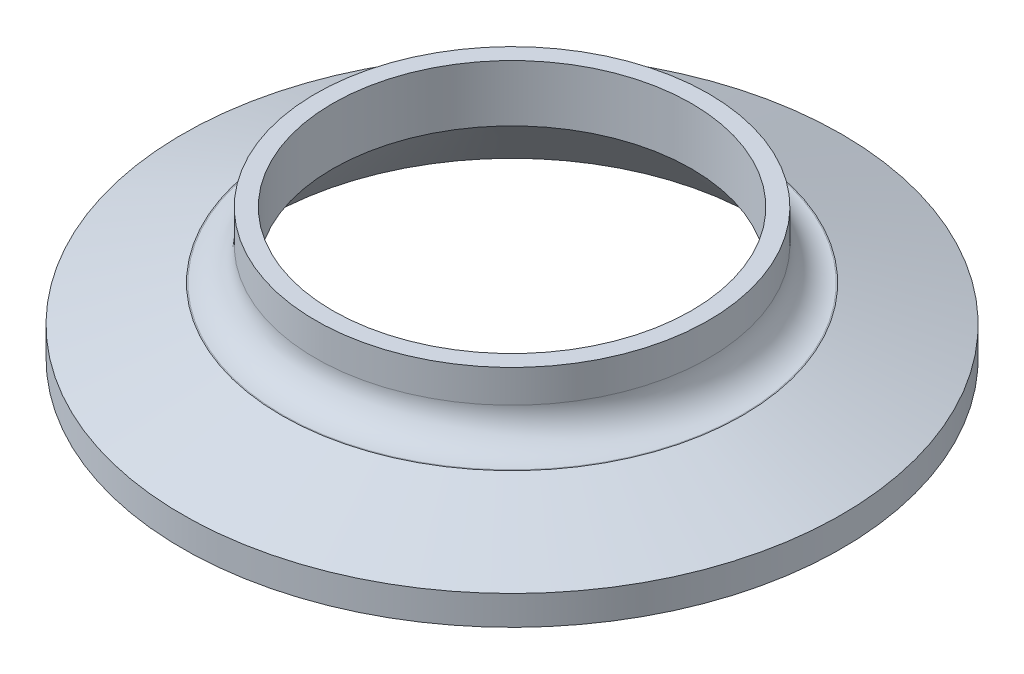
ISO-10303-21;
HEADER;
FILE_DESCRIPTION(('STEP AP214'),'2;1');
FILE_NAME('part.step','',(''),(''),'','','');
FILE_SCHEMA(('AUTOMOTIVE_DESIGN { 1 0 10303 214 1 1 1 1 }'));
ENDSEC;
DATA;
#1=APPLICATION_CONTEXT('core data for automotive mechanical design processes');
#2=APPLICATION_PROTOCOL_DEFINITION('international standard','automotive_design',2000,#1);
#3=PRODUCT_CONTEXT('',#1,'mechanical');
#4=PRODUCT('Part','Part','',(#3));
#5=PRODUCT_RELATED_PRODUCT_CATEGORY('part','',(#4));
#6=PRODUCT_DEFINITION_FORMATION('','',#4);
#7=PRODUCT_DEFINITION_CONTEXT('part definition',#1,'design');
#8=PRODUCT_DEFINITION('design','',#6,#7);
#9=PRODUCT_DEFINITION_SHAPE('','',#8);
#10=(LENGTH_UNIT() NAMED_UNIT(*) SI_UNIT(.MILLI.,.METRE.));
#11=(NAMED_UNIT(*) PLANE_ANGLE_UNIT() SI_UNIT($,.RADIAN.));
#12=(NAMED_UNIT(*) SI_UNIT($,.STERADIAN.) SOLID_ANGLE_UNIT());
#13=UNCERTAINTY_MEASURE_WITH_UNIT(LENGTH_MEASURE(1.E-05),#10,'distance_accuracy_value','');
#14=(GEOMETRIC_REPRESENTATION_CONTEXT(3) GLOBAL_UNCERTAINTY_ASSIGNED_CONTEXT((#13)) GLOBAL_UNIT_ASSIGNED_CONTEXT((#10,
#11,#12)) REPRESENTATION_CONTEXT('',''));
#15=CARTESIAN_POINT('',(0.,0.,0.));
#16=DIRECTION('',(0.,0.,1.));
#17=DIRECTION('',(1.,0.,0.));
#18=AXIS2_PLACEMENT_3D('',#15,#16,#17);
#19=CARTESIAN_POINT('',(-17.399,12.7,0.));
#20=DIRECTION('',(0.,-0.999999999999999,0.));
#21=DIRECTION('',(0.,0.,-1.));
#22=AXIS2_PLACEMENT_3D('',#19,#20,#21);
#23=PLANE('',#22);
#24=CARTESIAN_POINT('',(0.,12.7,0.));
#25=DIRECTION('',(0.,-0.999999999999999,0.));
#26=DIRECTION('',(0.,0.,-1.));
#27=AXIS2_PLACEMENT_3D('',#24,#25,#26);
#28=CIRCLE('',#27,19.05);
#29=CARTESIAN_POINT('',(0.,12.7,-19.0500000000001));
#30=VERTEX_POINT('',#29);
#31=EDGE_CURVE('E12',#30,#30,#28,.T.);
#32=ORIENTED_EDGE('',*,*,#31,.F.);
#33=EDGE_LOOP('',(#32));
#34=FACE_BOUND('',#33,.T.);
#35=CARTESIAN_POINT('',(0.,12.7,0.));
#36=DIRECTION('',(0.,-0.999999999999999,0.));
#37=DIRECTION('',(0.,0.,-1.));
#38=AXIS2_PLACEMENT_3D('',#35,#36,#37);
#39=CIRCLE('',#38,17.399);
#40=CARTESIAN_POINT('',(0.,12.7,-17.3990000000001));
#41=VERTEX_POINT('',#40);
#42=EDGE_CURVE('E87',#41,#41,#39,.T.);
#43=ORIENTED_EDGE('',*,*,#42,.T.);
#44=EDGE_LOOP('',(#43));
#45=FACE_BOUND('',#44,.T.);
#46=ADVANCED_FACE('F38',(#34,#45),#23,.F.);
#47=CARTESIAN_POINT('',(0.,0.,0.));
#48=DIRECTION('',(0.,-0.999999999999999,0.));
#49=DIRECTION('',(0.,0.,-1.));
#50=AXIS2_PLACEMENT_3D('',#47,#48,#49);
#51=CYLINDRICAL_SURFACE('',#50,19.05);
#52=CARTESIAN_POINT('',(0.,9.52499999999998,0.));
#53=DIRECTION('',(0.,-0.999999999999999,0.));
#54=DIRECTION('',(0.,0.,-1.));
#55=AXIS2_PLACEMENT_3D('',#52,#53,#54);
#56=CIRCLE('',#55,19.05);
#57=CARTESIAN_POINT('',(0.,9.52499999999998,-19.0500000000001));
#58=VERTEX_POINT('',#57);
#59=EDGE_CURVE('E44',#58,#58,#56,.T.);
#60=CARTESIAN_POINT('',(0.,9.52499999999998,-19.0500000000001));
#61=CARTESIAN_POINT('',(0.,9.55807291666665,-19.0500000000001));
#62=CARTESIAN_POINT('',(0.,9.59114583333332,-19.0500000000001));
#63=CARTESIAN_POINT('',(0.,9.65729166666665,-19.0500000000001));
#64=CARTESIAN_POINT('',(0.,9.69036458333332,-19.0500000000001));
#65=CARTESIAN_POINT('',(0.,9.75651041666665,-19.0500000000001));
#66=CARTESIAN_POINT('',(0.,9.78958333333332,-19.0500000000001));
#67=CARTESIAN_POINT('',(0.,9.85572916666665,-19.0500000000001));
#68=CARTESIAN_POINT('',(0.,9.88880208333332,-19.0500000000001));
#69=CARTESIAN_POINT('',(0.,9.95494791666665,-19.0500000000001));
#70=CARTESIAN_POINT('',(0.,9.98802083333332,-19.0500000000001));
#71=CARTESIAN_POINT('',(0.,10.0541666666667,-19.0500000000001));
#72=CARTESIAN_POINT('',(0.,10.0872395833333,-19.0500000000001));
#73=CARTESIAN_POINT('',(0.,10.1533854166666,-19.0500000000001));
#74=CARTESIAN_POINT('',(0.,10.1864583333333,-19.0500000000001));
#75=CARTESIAN_POINT('',(0.,10.2526041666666,-19.0500000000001));
#76=CARTESIAN_POINT('',(0.,10.2856770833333,-19.0500000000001));
#77=CARTESIAN_POINT('',(0.,10.3518229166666,-19.0500000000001));
#78=CARTESIAN_POINT('',(0.,10.3848958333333,-19.0500000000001));
#79=CARTESIAN_POINT('',(0.,10.4510416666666,-19.0500000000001));
#80=CARTESIAN_POINT('',(0.,10.4841145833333,-19.0500000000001));
#81=CARTESIAN_POINT('',(0.,10.5502604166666,-19.0500000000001));
#82=CARTESIAN_POINT('',(0.,10.5833333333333,-19.0500000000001));
#83=CARTESIAN_POINT('',(0.,10.6494791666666,-19.0500000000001));
#84=CARTESIAN_POINT('',(0.,10.6825520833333,-19.0500000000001));
#85=CARTESIAN_POINT('',(0.,10.7486979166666,-19.0500000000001));
#86=CARTESIAN_POINT('',(0.,10.7817708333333,-19.0500000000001));
#87=CARTESIAN_POINT('',(0.,10.8479166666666,-19.0500000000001));
#88=CARTESIAN_POINT('',(0.,10.8809895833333,-19.0500000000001));
#89=CARTESIAN_POINT('',(0.,10.9471354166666,-19.0500000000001));
#90=CARTESIAN_POINT('',(0.,10.9802083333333,-19.0500000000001));
#91=CARTESIAN_POINT('',(0.,11.0463541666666,-19.0500000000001));
#92=CARTESIAN_POINT('',(0.,11.0794270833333,-19.0500000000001));
#93=CARTESIAN_POINT('',(0.,11.1455729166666,-19.0500000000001));
#94=CARTESIAN_POINT('',(0.,11.1786458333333,-19.0500000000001));
#95=CARTESIAN_POINT('',(0.,11.2447916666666,-19.0500000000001));
#96=CARTESIAN_POINT('',(0.,11.2778645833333,-19.0500000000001));
#97=CARTESIAN_POINT('',(0.,11.3440104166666,-19.0500000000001));
#98=CARTESIAN_POINT('',(0.,11.3770833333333,-19.0500000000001));
#99=CARTESIAN_POINT('',(0.,11.4432291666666,-19.0500000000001));
#100=CARTESIAN_POINT('',(0.,11.4763020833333,-19.0500000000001));
#101=CARTESIAN_POINT('',(0.,11.5424479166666,-19.0500000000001));
#102=CARTESIAN_POINT('',(0.,11.5755208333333,-19.0500000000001));
#103=CARTESIAN_POINT('',(0.,11.6416666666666,-19.0500000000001));
#104=CARTESIAN_POINT('',(0.,11.6747395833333,-19.0500000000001));
#105=CARTESIAN_POINT('',(0.,11.7408854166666,-19.0500000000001));
#106=CARTESIAN_POINT('',(0.,11.7739583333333,-19.0500000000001));
#107=CARTESIAN_POINT('',(0.,11.8401041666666,-19.0500000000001));
#108=CARTESIAN_POINT('',(0.,11.8731770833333,-19.0500000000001));
#109=CARTESIAN_POINT('',(0.,11.9393229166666,-19.0500000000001));
#110=CARTESIAN_POINT('',(0.,11.9723958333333,-19.0500000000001));
#111=CARTESIAN_POINT('',(0.,12.0385416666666,-19.0500000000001));
#112=CARTESIAN_POINT('',(0.,12.0716145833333,-19.0500000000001));
#113=CARTESIAN_POINT('',(0.,12.1377604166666,-19.0500000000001));
#114=CARTESIAN_POINT('',(0.,12.1708333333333,-19.0500000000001));
#115=CARTESIAN_POINT('',(0.,12.2369791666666,-19.0500000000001));
#116=CARTESIAN_POINT('',(0.,12.2700520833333,-19.0500000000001));
#117=CARTESIAN_POINT('',(0.,12.3361979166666,-19.0500000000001));
#118=CARTESIAN_POINT('',(0.,12.3692708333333,-19.0500000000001));
#119=CARTESIAN_POINT('',(0.,12.4354166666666,-19.0500000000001));
#120=CARTESIAN_POINT('',(0.,12.4684895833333,-19.0500000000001));
#121=CARTESIAN_POINT('',(0.,12.5346354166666,-19.0500000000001));
#122=CARTESIAN_POINT('',(0.,12.5677083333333,-19.0500000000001));
#123=CARTESIAN_POINT('',(0.,12.6338541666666,-19.0500000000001));
#124=CARTESIAN_POINT('',(0.,12.6669270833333,-19.0500000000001));
#125=CARTESIAN_POINT('',(0.,12.7,-19.0500000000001));
#126=B_SPLINE_CURVE_WITH_KNOTS('',3,(#60,#61,#62,#63,#64,#65,#66,#67,#68,#69,#70,#71,#72,#73,
#74,#75,#76,#77,#78,#79,#80,#81,#82,#83,#84,#85,#86,#87,#88,#89,#90,#91,#92,#93,#94,#95,#96,#97,
#98,#99,#100,#101,#102,#103,#104,#105,#106,#107,#108,#109,#110,#111,#112,#113,#114,#115,#116,
#117,#118,#119,#120,#121,#122,#123,#124,#125),.UNSPECIFIED.,.F.,.F.,(4,2,2,2,2,2,2,2,2,2,2,2,2,
2,2,2,2,2,2,2,2,2,2,2,2,2,2,2,2,2,2,2,4),(0.,0.0992187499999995,0.198437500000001,0.29765625,
0.396875,0.496093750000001,0.5953125,0.694531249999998,0.793749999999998,0.892968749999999,
0.992187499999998,1.09140625,1.190625,1.28984375,1.3890625,1.48828125,1.5875,1.68671875,
1.7859375,1.88515625,1.984375,2.08359375,2.1828125,2.28203125,2.38125,2.48046875,2.5796875,
2.67890625,2.778125,2.87734375,2.9765625,3.07578125,3.175),.UNSPECIFIED.);
#127=EDGE_CURVE('BSEAM166',#58,#30,#126,.T.);
#128=ORIENTED_EDGE('',*,*,#59,.F.);
#129=ORIENTED_EDGE('',*,*,#31,.T.);
#130=ORIENTED_EDGE('',*,*,#127,.T.);
#131=ORIENTED_EDGE('',*,*,#127,.F.);
#132=EDGE_LOOP('',(#128,#130,#129,#131));
#133=FACE_BOUND('',#132,.T.);
#134=ADVANCED_FACE('F166',(#133),#51,.T.);
#135=CARTESIAN_POINT('',(0.,9.52499999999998,0.));
#136=DIRECTION('',(0.,-0.999999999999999,0.));
#137=DIRECTION('',(0.,0.,-1.));
#138=AXIS2_PLACEMENT_3D('',#135,#136,#137);
#139=TOROIDAL_SURFACE('',#138,22.225,3.175);
#140=CARTESIAN_POINT('',(0.,6.34999999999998,0.));
#141=DIRECTION('',(0.,-0.999999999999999,0.));
#142=DIRECTION('',(0.,0.,-1.));
#143=AXIS2_PLACEMENT_3D('',#140,#141,#142);
#144=CIRCLE('',#143,22.225);
#145=CARTESIAN_POINT('',(0.,6.34999999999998,-22.2250000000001));
#146=VERTEX_POINT('',#145);
#147=EDGE_CURVE('E48',#146,#146,#144,.T.);
#148=ORIENTED_EDGE('',*,*,#147,.F.);
#149=EDGE_LOOP('',(#148));
#150=FACE_BOUND('',#149,.T.);
#151=ORIENTED_EDGE('',*,*,#59,.T.);
#152=EDGE_LOOP('',(#151));
#153=FACE_BOUND('',#152,.T.);
#154=ADVANCED_FACE('F161',(#150,#153),#139,.F.);
#155=CARTESIAN_POINT('',(-22.225,6.35,0.));
#156=DIRECTION('',(0.,-0.999999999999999,0.));
#157=DIRECTION('',(0.,0.,-1.));
#158=AXIS2_PLACEMENT_3D('',#155,#156,#157);
#159=PLANE('',#158);
#160=CARTESIAN_POINT('',(0.,6.34999999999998,0.));
#161=DIRECTION('',(0.,-0.999999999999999,0.));
#162=DIRECTION('',(0.,0.,-1.));
#163=AXIS2_PLACEMENT_3D('',#160,#161,#162);
#164=CIRCLE('',#163,22.3227421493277);
#165=CARTESIAN_POINT('',(0.,6.34999999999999,-22.3227421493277));
#166=VERTEX_POINT('',#165);
#167=EDGE_CURVE('E52',#166,#166,#164,.T.);
#168=ORIENTED_EDGE('',*,*,#167,.F.);
#169=EDGE_LOOP('',(#168));
#170=FACE_BOUND('',#169,.T.);
#171=ORIENTED_EDGE('',*,*,#147,.T.);
#172=EDGE_LOOP('',(#171));
#173=FACE_BOUND('',#172,.T.);
#174=ADVANCED_FACE('F155',(#170,#173),#159,.F.);
#175=CARTESIAN_POINT('',(0.,6.34999999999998,0.));
#176=DIRECTION('',(0.,-0.999999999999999,0.));
#177=DIRECTION('',(0.,0.,-1.));
#178=AXIS2_PLACEMENT_3D('',#175,#176,#177);
#179=CONICAL_SURFACE('',#178,22.3227421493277,1.22173047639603);
#180=CARTESIAN_POINT('',(0.,2.84479999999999,0.));
#181=DIRECTION('',(0.,-0.999999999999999,0.));
#182=DIRECTION('',(0.,0.,-1.));
#183=AXIS2_PLACEMENT_3D('',#180,#181,#182);
#184=CIRCLE('',#183,31.9532);
#185=CARTESIAN_POINT('',(0.,2.8448,-31.9532000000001));
#186=VERTEX_POINT('',#185);
#187=EDGE_CURVE('E57',#186,#186,#184,.T.);
#188=CARTESIAN_POINT('',(0.,2.8448,-31.9532000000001));
#189=CARTESIAN_POINT('',(0.,2.8813125,-31.8528827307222));
#190=CARTESIAN_POINT('',(0.,2.917825,-31.7525654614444));
#191=CARTESIAN_POINT('',(0.,2.99085,-31.5519309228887));
#192=CARTESIAN_POINT('',(0.,3.0273625,-31.4516136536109));
#193=CARTESIAN_POINT('',(0.,3.1003875,-31.2509791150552));
#194=CARTESIAN_POINT('',(0.,3.1369,-31.1506618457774));
#195=CARTESIAN_POINT('',(0.,3.209925,-30.9500273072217));
#196=CARTESIAN_POINT('',(0.,3.2464375,-30.8497100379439));
#197=CARTESIAN_POINT('',(0.,3.3194625,-30.6490754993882));
#198=CARTESIAN_POINT('',(0.,3.355975,-30.5487582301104));
#199=CARTESIAN_POINT('',(0.,3.429,-30.3481236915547));
#200=CARTESIAN_POINT('',(0.,3.4655125,-30.2478064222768));
#201=CARTESIAN_POINT('',(0.,3.5385375,-30.0471718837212));
#202=CARTESIAN_POINT('',(0.,3.57505,-29.9468546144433));
#203=CARTESIAN_POINT('',(0.,3.648075,-29.7462200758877));
#204=CARTESIAN_POINT('',(0.,3.6845875,-29.6459028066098));
#205=CARTESIAN_POINT('',(0.,3.7576125,-29.4452682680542));
#206=CARTESIAN_POINT('',(0.,3.794125,-29.3449509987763));
#207=CARTESIAN_POINT('',(0.,3.86715,-29.1443164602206));
#208=CARTESIAN_POINT('',(0.,3.9036625,-29.0439991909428));
#209=CARTESIAN_POINT('',(0.,3.9766875,-28.8433646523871));
#210=CARTESIAN_POINT('',(0.,4.01319999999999,-28.7430473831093));
#211=CARTESIAN_POINT('',(0.,4.08622499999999,-28.5424128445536));
#212=CARTESIAN_POINT('',(0.,4.1227375,-28.4420955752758));
#213=CARTESIAN_POINT('',(0.,4.19576249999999,-28.2414610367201));
#214=CARTESIAN_POINT('',(0.,4.23227499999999,-28.1411437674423));
#215=CARTESIAN_POINT('',(0.,4.30529999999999,-27.9405092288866));
#216=CARTESIAN_POINT('',(0.,4.34181249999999,-27.8401919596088));
#217=CARTESIAN_POINT('',(0.,4.41483749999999,-27.6395574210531));
#218=CARTESIAN_POINT('',(0.,4.45134999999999,-27.5392401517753));
#219=CARTESIAN_POINT('',(0.,4.52437499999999,-27.3386056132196));
#220=CARTESIAN_POINT('',(0.,4.56088749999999,-27.2382883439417));
#221=CARTESIAN_POINT('',(0.,4.63391249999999,-27.0376538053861));
#222=CARTESIAN_POINT('',(0.,4.67042499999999,-26.9373365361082));
#223=CARTESIAN_POINT('',(0.,4.74344999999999,-26.7367019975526));
#224=CARTESIAN_POINT('',(0.,4.77996249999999,-26.6363847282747));
#225=CARTESIAN_POINT('',(0.,4.85298749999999,-26.4357501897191));
#226=CARTESIAN_POINT('',(0.,4.88949999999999,-26.3354329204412));
#227=CARTESIAN_POINT('',(0.,4.96252499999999,-26.1347983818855));
#228=CARTESIAN_POINT('',(0.,4.99903749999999,-26.0344811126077));
#229=CARTESIAN_POINT('',(0.,5.07206249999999,-25.833846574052));
#230=CARTESIAN_POINT('',(0.,5.10857499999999,-25.7335293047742));
#231=CARTESIAN_POINT('',(0.,5.18159999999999,-25.5328947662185));
#232=CARTESIAN_POINT('',(0.,5.21811249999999,-25.4325774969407));
#233=CARTESIAN_POINT('',(0.,5.29113749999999,-25.231942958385));
#234=CARTESIAN_POINT('',(0.,5.32764999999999,-25.1316256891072));
#235=CARTESIAN_POINT('',(0.,5.40067499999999,-24.9309911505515));
#236=CARTESIAN_POINT('',(0.,5.43718749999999,-24.8306738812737));
#237=CARTESIAN_POINT('',(0.,5.51021249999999,-24.630039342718));
#238=CARTESIAN_POINT('',(0.,5.54672499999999,-24.5297220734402));
#239=CARTESIAN_POINT('',(0.,5.61974999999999,-24.3290875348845));
#240=CARTESIAN_POINT('',(0.,5.65626249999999,-24.2287702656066));
#241=CARTESIAN_POINT('',(0.,5.72928749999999,-24.028135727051));
#242=CARTESIAN_POINT('',(0.,5.76579999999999,-23.9278184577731));
#243=CARTESIAN_POINT('',(0.,5.83882499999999,-23.7271839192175));
#244=CARTESIAN_POINT('',(0.,5.87533749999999,-23.6268666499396));
#245=CARTESIAN_POINT('',(0.,5.94836249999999,-23.4262321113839));
#246=CARTESIAN_POINT('',(0.,5.98487499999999,-23.3259148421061));
#247=CARTESIAN_POINT('',(0.,6.05789999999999,-23.1252803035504));
#248=CARTESIAN_POINT('',(0.,6.09441249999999,-23.0249630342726));
#249=CARTESIAN_POINT('',(0.,6.16743749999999,-22.8243284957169));
#250=CARTESIAN_POINT('',(0.,6.20394999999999,-22.7240112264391));
#251=CARTESIAN_POINT('',(0.,6.27697499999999,-22.5233766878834));
#252=CARTESIAN_POINT('',(0.,6.31348749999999,-22.4230594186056));
#253=CARTESIAN_POINT('',(0.,6.34999999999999,-22.3227421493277));
#254=B_SPLINE_CURVE_WITH_KNOTS('',3,(#188,#189,#190,#191,#192,#193,#194,#195,#196,#197,#198,
#199,#200,#201,#202,#203,#204,#205,#206,#207,#208,#209,#210,#211,#212,#213,#214,#215,#216,#217,
#218,#219,#220,#221,#222,#223,#224,#225,#226,#227,#228,#229,#230,#231,#232,#233,#234,#235,#236,
#237,#238,#239,#240,#241,#242,#243,#244,#245,#246,#247,#248,#249,#250,#251,#252,#253),
.UNSPECIFIED.,.F.,.F.,(4,2,2,2,2,2,2,2,2,2,2,2,2,2,2,2,2,2,2,2,2,2,2,2,2,2,2,2,2,2,2,2,4),(0.,
0.320266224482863,0.640532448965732,0.960798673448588,1.28106489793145,1.60133112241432,
1.92159734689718,2.24186357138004,2.56212979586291,2.88239602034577,3.20266224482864,
3.5229284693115,3.84319469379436,4.16346091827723,4.48372714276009,4.80399336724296,
5.12425959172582,5.44452581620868,5.76479204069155,6.08505826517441,6.40532448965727,
6.72559071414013,7.045856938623,7.36612316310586,7.68638938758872,8.00665561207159,
8.32692183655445,8.64718806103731,8.96745428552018,9.28772051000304,9.60798673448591,
9.92825295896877,10.2485191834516),.UNSPECIFIED.);
#255=EDGE_CURVE('BSEAM149',#186,#166,#254,.T.);
#256=ORIENTED_EDGE('',*,*,#187,.F.);
#257=ORIENTED_EDGE('',*,*,#167,.T.);
#258=ORIENTED_EDGE('',*,*,#255,.T.);
#259=ORIENTED_EDGE('',*,*,#255,.F.);
#260=EDGE_LOOP('',(#256,#258,#257,#259));
#261=FACE_BOUND('',#260,.T.);
#262=ADVANCED_FACE('F149',(#261),#179,.T.);
#263=CARTESIAN_POINT('',(0.,0.,0.));
#264=DIRECTION('',(0.,-0.999999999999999,0.));
#265=DIRECTION('',(0.,0.,-1.));
#266=AXIS2_PLACEMENT_3D('',#263,#264,#265);
#267=CYLINDRICAL_SURFACE('',#266,31.9532);
#268=CARTESIAN_POINT('',(0.,0.,0.));
#269=DIRECTION('',(0.,-0.999999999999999,0.));
#270=DIRECTION('',(0.,0.,-1.));
#271=AXIS2_PLACEMENT_3D('',#268,#269,#270);
#272=CIRCLE('',#271,31.9532);
#273=CARTESIAN_POINT('',(0.,0.,-31.9532000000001));
#274=VERTEX_POINT('',#273);
#275=EDGE_CURVE('E60',#274,#274,#272,.T.);
#276=CARTESIAN_POINT('',(0.,0.,-31.9532000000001));
#277=CARTESIAN_POINT('',(0.,0.0296333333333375,-31.9532000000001));
#278=CARTESIAN_POINT('',(0.,0.0592666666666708,-31.9532000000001));
#279=CARTESIAN_POINT('',(0.,0.118533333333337,-31.9532000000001));
#280=CARTESIAN_POINT('',(0.,0.148166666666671,-31.9532000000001));
#281=CARTESIAN_POINT('',(0.,0.207433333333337,-31.9532000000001));
#282=CARTESIAN_POINT('',(0.,0.23706666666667,-31.9532000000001));
#283=CARTESIAN_POINT('',(0.,0.296333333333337,-31.9532000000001));
#284=CARTESIAN_POINT('',(0.,0.32596666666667,-31.9532000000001));
#285=CARTESIAN_POINT('',(0.,0.385233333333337,-31.9532000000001));
#286=CARTESIAN_POINT('',(0.,0.41486666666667,-31.9532000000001));
#287=CARTESIAN_POINT('',(0.,0.474133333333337,-31.9532000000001));
#288=CARTESIAN_POINT('',(0.,0.50376666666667,-31.9532000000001));
#289=CARTESIAN_POINT('',(0.,0.563033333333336,-31.9532000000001));
#290=CARTESIAN_POINT('',(0.,0.59266666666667,-31.9532000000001));
#291=CARTESIAN_POINT('',(0.,0.651933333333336,-31.9532000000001));
#292=CARTESIAN_POINT('',(0.,0.681566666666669,-31.9532000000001));
#293=CARTESIAN_POINT('',(0.,0.740833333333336,-31.9532000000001));
#294=CARTESIAN_POINT('',(0.,0.770466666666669,-31.9532000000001));
#295=CARTESIAN_POINT('',(0.,0.829733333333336,-31.9532000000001));
#296=CARTESIAN_POINT('',(0.,0.859366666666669,-31.9532000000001));
#297=CARTESIAN_POINT('',(0.,0.918633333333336,-31.9532000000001));
#298=CARTESIAN_POINT('',(0.,0.948266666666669,-31.9532000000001));
#299=CARTESIAN_POINT('',(0.,1.00753333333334,-31.9532000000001));
#300=CARTESIAN_POINT('',(0.,1.03716666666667,-31.9532000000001));
#301=CARTESIAN_POINT('',(0.,1.09643333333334,-31.9532000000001));
#302=CARTESIAN_POINT('',(0.,1.12606666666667,-31.9532000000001));
#303=CARTESIAN_POINT('',(0.,1.18533333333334,-31.9532000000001));
#304=CARTESIAN_POINT('',(0.,1.21496666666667,-31.9532000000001));
#305=CARTESIAN_POINT('',(0.,1.27423333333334,-31.9532000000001));
#306=CARTESIAN_POINT('',(0.,1.30386666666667,-31.9532000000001));
#307=CARTESIAN_POINT('',(0.,1.36313333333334,-31.9532000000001));
#308=CARTESIAN_POINT('',(0.,1.39276666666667,-31.9532000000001));
#309=CARTESIAN_POINT('',(0.,1.45203333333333,-31.9532000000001));
#310=CARTESIAN_POINT('',(0.,1.48166666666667,-31.9532000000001));
#311=CARTESIAN_POINT('',(0.,1.54093333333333,-31.9532000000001));
#312=CARTESIAN_POINT('',(0.,1.57056666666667,-31.9532000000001));
#313=CARTESIAN_POINT('',(0.,1.62983333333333,-31.9532000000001));
#314=CARTESIAN_POINT('',(0.,1.65946666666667,-31.9532000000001));
#315=CARTESIAN_POINT('',(0.,1.71873333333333,-31.9532000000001));
#316=CARTESIAN_POINT('',(0.,1.74836666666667,-31.9532000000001));
#317=CARTESIAN_POINT('',(0.,1.80763333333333,-31.9532000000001));
#318=CARTESIAN_POINT('',(0.,1.83726666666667,-31.9532000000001));
#319=CARTESIAN_POINT('',(0.,1.89653333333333,-31.9532000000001));
#320=CARTESIAN_POINT('',(0.,1.92616666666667,-31.9532000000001));
#321=CARTESIAN_POINT('',(0.,1.98543333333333,-31.9532000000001));
#322=CARTESIAN_POINT('',(0.,2.01506666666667,-31.9532000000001));
#323=CARTESIAN_POINT('',(0.,2.07433333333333,-31.9532000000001));
#324=CARTESIAN_POINT('',(0.,2.10396666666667,-31.9532000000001));
#325=CARTESIAN_POINT('',(0.,2.16323333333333,-31.9532000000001));
#326=CARTESIAN_POINT('',(0.,2.19286666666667,-31.9532000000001));
#327=CARTESIAN_POINT('',(0.,2.25213333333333,-31.9532000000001));
#328=CARTESIAN_POINT('',(0.,2.28176666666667,-31.9532000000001));
#329=CARTESIAN_POINT('',(0.,2.34103333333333,-31.9532000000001));
#330=CARTESIAN_POINT('',(0.,2.37066666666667,-31.9532000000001));
#331=CARTESIAN_POINT('',(0.,2.42993333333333,-31.9532000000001));
#332=CARTESIAN_POINT('',(0.,2.45956666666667,-31.9532000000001));
#333=CARTESIAN_POINT('',(0.,2.51883333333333,-31.9532000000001));
#334=CARTESIAN_POINT('',(0.,2.54846666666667,-31.9532000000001));
#335=CARTESIAN_POINT('',(0.,2.60773333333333,-31.9532000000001));
#336=CARTESIAN_POINT('',(0.,2.63736666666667,-31.9532000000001));
#337=CARTESIAN_POINT('',(0.,2.69663333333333,-31.9532000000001));
#338=CARTESIAN_POINT('',(0.,2.72626666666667,-31.9532000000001));
#339=CARTESIAN_POINT('',(0.,2.78553333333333,-31.9532000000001));
#340=CARTESIAN_POINT('',(0.,2.81516666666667,-31.9532000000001));
#341=CARTESIAN_POINT('',(0.,2.8448,-31.9532000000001));
#342=B_SPLINE_CURVE_WITH_KNOTS('',3,(#276,#277,#278,#279,#280,#281,#282,#283,#284,#285,#286,
#287,#288,#289,#290,#291,#292,#293,#294,#295,#296,#297,#298,#299,#300,#301,#302,#303,#304,#305,
#306,#307,#308,#309,#310,#311,#312,#313,#314,#315,#316,#317,#318,#319,#320,#321,#322,#323,#324,
#325,#326,#327,#328,#329,#330,#331,#332,#333,#334,#335,#336,#337,#338,#339,#340,#341),
.UNSPECIFIED.,.F.,.F.,(4,2,2,2,2,2,2,2,2,2,2,2,2,2,2,2,2,2,2,2,2,2,2,2,2,2,2,2,2,2,2,2,4),(0.,
0.0888999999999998,0.1778,0.2667,0.355599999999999,0.444499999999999,0.533399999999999,
0.622299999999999,0.711199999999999,0.800099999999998,0.888999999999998,0.977899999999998,
1.0668,1.1557,1.2446,1.3335,1.4224,1.5113,1.6002,1.6891,1.778,1.8669,1.9558,2.0447,2.1336,
2.2225,2.3114,2.4003,2.4892,2.57809999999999,2.66699999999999,2.75589999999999,
2.84479999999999),.UNSPECIFIED.);
#343=EDGE_CURVE('BSEAM143',#274,#186,#342,.T.);
#344=ORIENTED_EDGE('',*,*,#275,.F.);
#345=ORIENTED_EDGE('',*,*,#187,.T.);
#346=ORIENTED_EDGE('',*,*,#343,.T.);
#347=ORIENTED_EDGE('',*,*,#343,.F.);
#348=EDGE_LOOP('',(#344,#346,#345,#347));
#349=FACE_BOUND('',#348,.T.);
#350=ADVANCED_FACE('F143',(#349),#267,.T.);
#351=CARTESIAN_POINT('',(0.,0.,0.));
#352=DIRECTION('',(0.,-0.999999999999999,0.));
#353=DIRECTION('',(0.,0.,-1.));
#354=AXIS2_PLACEMENT_3D('',#351,#352,#353);
#355=CONICAL_SURFACE('',#354,31.9532,1.56939586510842);
#356=CARTESIAN_POINT('',(0.,0.0025124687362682,0.));
#357=DIRECTION('',(0.,-0.999999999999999,0.));
#358=DIRECTION('',(0.,0.,-1.));
#359=AXIS2_PLACEMENT_3D('',#356,#357,#358);
#360=CIRCLE('',#359,30.1591722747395);
#361=CARTESIAN_POINT('',(0.,0.00251246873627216,-30.1591722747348));
#362=VERTEX_POINT('',#361);
#363=EDGE_CURVE('E63',#362,#362,#360,.T.);
#364=CARTESIAN_POINT('',(0.,0.00251246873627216,-30.1591722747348));
#365=CARTESIAN_POINT('',(0.,0.00248629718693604,-30.1778600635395));
#366=CARTESIAN_POINT('',(0.,0.00246012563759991,-30.1965478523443));
#367=CARTESIAN_POINT('',(0.,0.00240778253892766,-30.2339234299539));
#368=CARTESIAN_POINT('',(0.,0.00238161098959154,-30.2526112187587));
#369=CARTESIAN_POINT('',(0.,0.00232926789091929,-30.2899867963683));
#370=CARTESIAN_POINT('',(0.,0.00230309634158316,-30.308674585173));
#371=CARTESIAN_POINT('',(0.,0.00225075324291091,-30.3460501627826));
#372=CARTESIAN_POINT('',(0.,0.00222458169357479,-30.3647379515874));
#373=CARTESIAN_POINT('',(0.,0.00217223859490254,-30.402113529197));
#374=CARTESIAN_POINT('',(0.,0.00214606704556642,-30.4208013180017));
#375=CARTESIAN_POINT('',(0.,0.00209372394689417,-30.4581768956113));
#376=CARTESIAN_POINT('',(0.,0.00206755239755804,-30.4768646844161));
#377=CARTESIAN_POINT('',(0.,0.00201520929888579,-30.5142402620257));
#378=CARTESIAN_POINT('',(0.,0.00198903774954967,-30.5329280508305));
#379=CARTESIAN_POINT('',(0.,0.00193669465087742,-30.57030362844));
#380=CARTESIAN_POINT('',(0.,0.00191052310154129,-30.5889914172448));
#381=CARTESIAN_POINT('',(0.,0.00185818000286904,-30.6263669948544));
#382=CARTESIAN_POINT('',(0.,0.00183200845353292,-30.6450547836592));
#383=CARTESIAN_POINT('',(0.,0.00177966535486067,-30.6824303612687));
#384=CARTESIAN_POINT('',(0.,0.00175349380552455,-30.7011181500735));
#385=CARTESIAN_POINT('',(0.,0.0017011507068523,-30.7384937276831));
#386=CARTESIAN_POINT('',(0.,0.00167497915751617,-30.7571815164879));
#387=CARTESIAN_POINT('',(0.,0.00162263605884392,-30.7945570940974));
#388=CARTESIAN_POINT('',(0.,0.0015964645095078,-30.8132448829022));
#389=CARTESIAN_POINT('',(0.,0.00154412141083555,-30.8506204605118));
#390=CARTESIAN_POINT('',(0.,0.00151794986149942,-30.8693082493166));
#391=CARTESIAN_POINT('',(0.,0.00146560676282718,-30.9066838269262));
#392=CARTESIAN_POINT('',(0.,0.00143943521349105,-30.9253716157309));
#393=CARTESIAN_POINT('',(0.,0.0013870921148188,-30.9627471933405));
#394=CARTESIAN_POINT('',(0.,0.00136092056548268,-30.9814349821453));
#395=CARTESIAN_POINT('',(0.,0.00130857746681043,-31.0188105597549));
#396=CARTESIAN_POINT('',(0.,0.0012824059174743,-31.0374983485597));
#397=CARTESIAN_POINT('',(0.,0.00123006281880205,-31.0748739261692));
#398=CARTESIAN_POINT('',(0.,0.00120389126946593,-31.093561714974));
#399=CARTESIAN_POINT('',(0.,0.00115154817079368,-31.1309372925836));
#400=CARTESIAN_POINT('',(0.,0.00112537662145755,-31.1496250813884));
#401=CARTESIAN_POINT('',(0.,0.0010730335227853,-31.1870006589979));
#402=CARTESIAN_POINT('',(0.,0.00104686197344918,-31.2056884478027));
#403=CARTESIAN_POINT('',(0.,0.000994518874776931,-31.2430640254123));
#404=CARTESIAN_POINT('',(0.,0.000968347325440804,-31.2617518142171));
#405=CARTESIAN_POINT('',(0.,0.000916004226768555,-31.2991273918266));
#406=CARTESIAN_POINT('',(0.,0.000889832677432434,-31.3178151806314));
#407=CARTESIAN_POINT('',(0.,0.000837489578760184,-31.355190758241));
#408=CARTESIAN_POINT('',(0.,0.000811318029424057,-31.3738785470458));
#409=CARTESIAN_POINT('',(0.,0.000758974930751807,-31.4112541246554));
#410=CARTESIAN_POINT('',(0.,0.000732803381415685,-31.4299419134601));
#411=CARTESIAN_POINT('',(0.,0.000680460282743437,-31.4673174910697));
#412=CARTESIAN_POINT('',(0.,0.000654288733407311,-31.4860052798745));
#413=CARTESIAN_POINT('',(0.,0.00060194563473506,-31.5233808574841));
#414=CARTESIAN_POINT('',(0.,0.000575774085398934,-31.5420686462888));
#415=CARTESIAN_POINT('',(0.,0.000523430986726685,-31.5794442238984));
#416=CARTESIAN_POINT('',(0.,0.000497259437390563,-31.5981320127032));
#417=CARTESIAN_POINT('',(0.,0.000444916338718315,-31.6355075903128));
#418=CARTESIAN_POINT('',(0.,0.000418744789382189,-31.6541953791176));
#419=CARTESIAN_POINT('',(0.,0.000366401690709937,-31.6915709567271));
#420=CARTESIAN_POINT('',(0.,0.000340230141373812,-31.7102587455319));
#421=CARTESIAN_POINT('',(0.,0.000287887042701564,-31.7476343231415));
#422=CARTESIAN_POINT('',(0.,0.000261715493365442,-31.7663221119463));
#423=CARTESIAN_POINT('',(0.,0.000209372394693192,-31.8036976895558));
#424=CARTESIAN_POINT('',(0.,0.000183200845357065,-31.8223854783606));
#425=CARTESIAN_POINT('',(0.,0.000130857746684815,-31.8597610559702));
#426=CARTESIAN_POINT('',(0.,0.000104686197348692,-31.878448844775));
#427=CARTESIAN_POINT('',(0.,5.23430986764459E-05,-31.9158244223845));
#428=CARTESIAN_POINT('',(0.,2.61715493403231E-05,-31.9345122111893));
#429=CARTESIAN_POINT('',(0.,0.,-31.9531999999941));
#430=B_SPLINE_CURVE_WITH_KNOTS('',3,(#364,#365,#366,#367,#368,#369,#370,#371,#372,#373,#374,
#375,#376,#377,#378,#379,#380,#381,#382,#383,#384,#385,#386,#387,#388,#389,#390,#391,#392,#393,
#394,#395,#396,#397,#398,#399,#400,#401,#402,#403,#404,#405,#406,#407,#408,#409,#410,#411,#412,
#413,#414,#415,#416,#417,#418,#419,#420,#421,#422,#423,#424,#425,#426,#427,#428,#429),
.UNSPECIFIED.,.F.,.F.,(4,2,2,2,2,2,2,2,2,2,2,2,2,2,2,2,2,2,2,2,2,2,2,2,2,2,2,2,2,2,2,2,4),(0.,
0.0560634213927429,0.112126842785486,0.168190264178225,0.224253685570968,0.280317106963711,
0.336380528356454,0.392443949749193,0.448507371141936,0.504570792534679,0.560634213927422,
0.616697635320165,0.672761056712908,0.728824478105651,0.784887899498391,0.840951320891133,
0.897014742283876,0.953078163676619,1.00914158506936,1.0652050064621,1.12126842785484,
1.17733184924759,1.23339527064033,1.28945869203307,1.34552211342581,1.40158553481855,
1.4576489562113,1.51371237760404,1.56977579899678,1.62583922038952,1.68190264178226,
1.73796606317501,1.79402948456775),.UNSPECIFIED.);
#431=EDGE_CURVE('BSEAM137',#362,#274,#430,.T.);
#432=ORIENTED_EDGE('',*,*,#363,.F.);
#433=ORIENTED_EDGE('',*,*,#275,.T.);
#434=ORIENTED_EDGE('',*,*,#431,.T.);
#435=ORIENTED_EDGE('',*,*,#431,.F.);
#436=EDGE_LOOP('',(#432,#434,#433,#435));
#437=FACE_BOUND('',#436,.T.);
#438=ADVANCED_FACE('F137',(#437),#355,.F.);
#439=CARTESIAN_POINT('',(0.,0.789912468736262,0.));
#440=DIRECTION('',(0.,-0.999999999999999,0.));
#441=DIRECTION('',(0.,0.,-1.));
#442=AXIS2_PLACEMENT_3D('',#439,#440,#441);
#443=TOROIDAL_SURFACE('',#442,30.1591722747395,0.787400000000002);
#444=CARTESIAN_POINT('',(0.,0.482250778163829,0.));
#445=DIRECTION('',(0.,-0.999999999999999,0.));
#446=DIRECTION('',(0.,0.,-1.));
#447=AXIS2_PLACEMENT_3D('',#444,#445,#446);
#448=CIRCLE('',#447,29.434366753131);
#449=CARTESIAN_POINT('',(0.,0.482250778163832,-29.4343667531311));
#450=VERTEX_POINT('',#449);
#451=EDGE_CURVE('E66',#450,#450,#448,.T.);
#452=ORIENTED_EDGE('',*,*,#451,.F.);
#453=EDGE_LOOP('',(#452));
#454=FACE_BOUND('',#453,.T.);
#455=ORIENTED_EDGE('',*,*,#363,.T.);
#456=EDGE_LOOP('',(#455));
#457=FACE_BOUND('',#456,.T.);
#458=ADVANCED_FACE('F131',(#454,#457),#443,.T.);
#459=CARTESIAN_POINT('',(0.,0.482250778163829,0.));
#460=DIRECTION('',(0.,-0.999999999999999,0.));
#461=DIRECTION('',(0.,0.,-1.));
#462=AXIS2_PLACEMENT_3D('',#459,#460,#461);
#463=CONICAL_SURFACE('',#462,29.434366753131,0.401425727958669);
#464=CARTESIAN_POINT('',(0.,0.875367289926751,0.));
#465=DIRECTION('',(0.,-0.999999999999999,0.));
#466=DIRECTION('',(0.,0.,-1.));
#467=AXIS2_PLACEMENT_3D('',#464,#465,#466);
#468=CIRCLE('',#467,29.2674986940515);
#469=CARTESIAN_POINT('',(0.,0.875367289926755,-29.2674986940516));
#470=VERTEX_POINT('',#469);
#471=EDGE_CURVE('E69',#470,#470,#468,.T.);
#472=CARTESIAN_POINT('',(0.,0.875367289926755,-29.2674986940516));
#473=CARTESIAN_POINT('',(0.,0.871272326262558,-29.2692369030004));
#474=CARTESIAN_POINT('',(0.,0.867177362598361,-29.2709751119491));
#475=CARTESIAN_POINT('',(0.,0.858987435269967,-29.2744515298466));
#476=CARTESIAN_POINT('',(0.,0.854892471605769,-29.2761897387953));
#477=CARTESIAN_POINT('',(0.,0.846702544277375,-29.2796661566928));
#478=CARTESIAN_POINT('',(0.,0.842607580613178,-29.2814043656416));
#479=CARTESIAN_POINT('',(0.,0.834417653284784,-29.2848807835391));
#480=CARTESIAN_POINT('',(0.,0.830322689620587,-29.2866189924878));
#481=CARTESIAN_POINT('',(0.,0.822132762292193,-29.2900954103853));
#482=CARTESIAN_POINT('',(0.,0.818037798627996,-29.2918336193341));
#483=CARTESIAN_POINT('',(0.,0.809847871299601,-29.2953100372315));
#484=CARTESIAN_POINT('',(0.,0.805752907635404,-29.2970482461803));
#485=CARTESIAN_POINT('',(0.,0.79756298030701,-29.3005246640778));
#486=CARTESIAN_POINT('',(0.,0.793468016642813,-29.3022628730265));
#487=CARTESIAN_POINT('',(0.,0.785278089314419,-29.305739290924));
#488=CARTESIAN_POINT('',(0.,0.781183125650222,-29.3074774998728));
#489=CARTESIAN_POINT('',(0.,0.772993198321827,-29.3109539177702));
#490=CARTESIAN_POINT('',(0.,0.76889823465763,-29.312692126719));
#491=CARTESIAN_POINT('',(0.,0.760708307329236,-29.3161685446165));
#492=CARTESIAN_POINT('',(0.,0.756613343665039,-29.3179067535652));
#493=CARTESIAN_POINT('',(0.,0.748423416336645,-29.3213831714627));
#494=CARTESIAN_POINT('',(0.,0.744328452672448,-29.3231213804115));
#495=CARTESIAN_POINT('',(0.,0.736138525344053,-29.326597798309));
#496=CARTESIAN_POINT('',(0.,0.732043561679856,-29.3283360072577));
#497=CARTESIAN_POINT('',(0.,0.723853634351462,-29.3318124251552));
#498=CARTESIAN_POINT('',(0.,0.719758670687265,-29.3335506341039));
#499=CARTESIAN_POINT('',(0.,0.711568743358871,-29.3370270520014));
#500=CARTESIAN_POINT('',(0.,0.707473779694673,-29.3387652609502));
#501=CARTESIAN_POINT('',(0.,0.699283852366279,-29.3422416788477));
#502=CARTESIAN_POINT('',(0.,0.695188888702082,-29.3439798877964));
#503=CARTESIAN_POINT('',(0.,0.686998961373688,-29.3474563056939));
#504=CARTESIAN_POINT('',(0.,0.682903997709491,-29.3491945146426));
#505=CARTESIAN_POINT('',(0.,0.674714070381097,-29.3526709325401));
#506=CARTESIAN_POINT('',(0.,0.6706191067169,-29.3544091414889));
#507=CARTESIAN_POINT('',(0.,0.662429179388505,-29.3578855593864));
#508=CARTESIAN_POINT('',(0.,0.658334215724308,-29.3596237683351));
#509=CARTESIAN_POINT('',(0.,0.650144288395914,-29.3631001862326));
#510=CARTESIAN_POINT('',(0.,0.646049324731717,-29.3648383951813));
#511=CARTESIAN_POINT('',(0.,0.637859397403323,-29.3683148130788));
#512=CARTESIAN_POINT('',(0.,0.633764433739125,-29.3700530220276));
#513=CARTESIAN_POINT('',(0.,0.625574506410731,-29.3735294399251));
#514=CARTESIAN_POINT('',(0.,0.621479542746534,-29.3752676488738));
#515=CARTESIAN_POINT('',(0.,0.61328961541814,-29.3787440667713));
#516=CARTESIAN_POINT('',(0.,0.609194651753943,-29.38048227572));
#517=CARTESIAN_POINT('',(0.,0.601004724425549,-29.3839586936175));
#518=CARTESIAN_POINT('',(0.,0.596909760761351,-29.3856969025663));
#519=CARTESIAN_POINT('',(0.,0.588719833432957,-29.3891733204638));
#520=CARTESIAN_POINT('',(0.,0.58462486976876,-29.3909115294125));
#521=CARTESIAN_POINT('',(0.,0.576434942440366,-29.39438794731));
#522=CARTESIAN_POINT('',(0.,0.572339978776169,-29.3961261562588));
#523=CARTESIAN_POINT('',(0.,0.564150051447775,-29.3996025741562));
#524=CARTESIAN_POINT('',(0.,0.560055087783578,-29.401340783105));
#525=CARTESIAN_POINT('',(0.,0.551865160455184,-29.4048172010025));
#526=CARTESIAN_POINT('',(0.,0.547770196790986,-29.4065554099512));
#527=CARTESIAN_POINT('',(0.,0.539580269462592,-29.4100318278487));
#528=CARTESIAN_POINT('',(0.,0.535485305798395,-29.4117700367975));
#529=CARTESIAN_POINT('',(0.,0.527295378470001,-29.4152464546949));
#530=CARTESIAN_POINT('',(0.,0.523200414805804,-29.4169846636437));
#531=CARTESIAN_POINT('',(0.,0.515010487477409,-29.4204610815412));
#532=CARTESIAN_POINT('',(0.,0.510915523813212,-29.4221992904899));
#533=CARTESIAN_POINT('',(0.,0.502725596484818,-29.4256757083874));
#534=CARTESIAN_POINT('',(0.,0.498630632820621,-29.4274139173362));
#535=CARTESIAN_POINT('',(0.,0.490440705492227,-29.4308903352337));
#536=CARTESIAN_POINT('',(0.,0.48634574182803,-29.4326285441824));
#537=CARTESIAN_POINT('',(0.,0.482250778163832,-29.4343667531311));
#538=B_SPLINE_CURVE_WITH_KNOTS('',3,(#472,#473,#474,#475,#476,#477,#478,#479,#480,#481,#482,
#483,#484,#485,#486,#487,#488,#489,#490,#491,#492,#493,#494,#495,#496,#497,#498,#499,#500,#501,
#502,#503,#504,#505,#506,#507,#508,#509,#510,#511,#512,#513,#514,#515,#516,#517,#518,#519,#520,
#521,#522,#523,#524,#525,#526,#527,#528,#529,#530,#531,#532,#533,#534,#535,#536,#537),
.UNSPECIFIED.,.F.,.F.,(4,2,2,2,2,2,2,2,2,2,2,2,2,2,2,2,2,2,2,2,2,2,2,2,2,2,2,2,2,2,2,2,4),(0.,
0.0133458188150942,0.0266916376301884,0.0400374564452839,0.0533832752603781,0.0667290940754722,
0.0800749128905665,0.0934207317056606,0.106766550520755,0.120112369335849,0.133458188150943,
0.146804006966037,0.160149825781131,0.173495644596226,0.18684146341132,0.200187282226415,
0.21353310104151,0.226878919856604,0.240224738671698,0.253570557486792,0.266916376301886,
0.28026219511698,0.293608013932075,0.306953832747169,0.320299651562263,0.333645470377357,
0.346991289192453,0.360337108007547,0.373682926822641,0.387028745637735,0.40037456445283,
0.413720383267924,0.427066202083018),.UNSPECIFIED.);
#539=EDGE_CURVE('BSEAM125',#470,#450,#538,.T.);
#540=ORIENTED_EDGE('',*,*,#471,.F.);
#541=ORIENTED_EDGE('',*,*,#451,.T.);
#542=ORIENTED_EDGE('',*,*,#539,.T.);
#543=ORIENTED_EDGE('',*,*,#539,.F.);
#544=EDGE_LOOP('',(#540,#542,#541,#543));
#545=FACE_BOUND('',#544,.T.);
#546=ADVANCED_FACE('F125',(#545),#463,.F.);
#547=CARTESIAN_POINT('',(0.,0.408912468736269,0.));
#548=DIRECTION('',(0.,-0.999999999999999,0.));
#549=DIRECTION('',(0.,0.,-1.));
#550=AXIS2_PLACEMENT_3D('',#547,#548,#549);
#551=TOROIDAL_SURFACE('',#550,28.1686,1.1938);
#552=CARTESIAN_POINT('',(0.,0.875367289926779,0.));
#553=DIRECTION('',(0.,-0.999999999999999,0.));
#554=DIRECTION('',(0.,0.,-1.));
#555=AXIS2_PLACEMENT_3D('',#552,#553,#554);
#556=CIRCLE('',#555,27.0697013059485);
#557=CARTESIAN_POINT('',(0.,0.875367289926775,27.0697013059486));
#558=VERTEX_POINT('',#557);
#559=EDGE_CURVE('E72',#558,#558,#556,.T.);
#560=ORIENTED_EDGE('',*,*,#559,.F.);
#561=EDGE_LOOP('',(#560));
#562=FACE_BOUND('',#561,.T.);
#563=ORIENTED_EDGE('',*,*,#471,.T.);
#564=EDGE_LOOP('',(#563));
#565=FACE_BOUND('',#564,.T.);
#566=ADVANCED_FACE('F119',(#562,#565),#551,.F.);
#567=CARTESIAN_POINT('',(0.,0.875367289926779,0.));
#568=DIRECTION('',(0.,0.999999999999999,0.));
#569=DIRECTION('',(0.,0.,1.));
#570=AXIS2_PLACEMENT_3D('',#567,#568,#569);
#571=CONICAL_SURFACE('',#570,27.0697013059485,0.401425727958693);
#572=CARTESIAN_POINT('',(0.,0.482250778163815,0.));
#573=DIRECTION('',(0.,-0.999999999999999,0.));
#574=DIRECTION('',(0.,0.,-1.));
#575=AXIS2_PLACEMENT_3D('',#572,#573,#574);
#576=CIRCLE('',#575,26.9028332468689);
#577=CARTESIAN_POINT('',(0.,0.482250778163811,26.902833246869));
#578=VERTEX_POINT('',#577);
#579=EDGE_CURVE('E75',#578,#578,#576,.T.);
#580=CARTESIAN_POINT('',(0.,0.482250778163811,26.902833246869));
#581=CARTESIAN_POINT('',(0.,0.486345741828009,26.9045714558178));
#582=CARTESIAN_POINT('',(0.,0.490440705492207,26.9063096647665));
#583=CARTESIAN_POINT('',(0.,0.498630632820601,26.909786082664));
#584=CARTESIAN_POINT('',(0.,0.502725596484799,26.9115242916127));
#585=CARTESIAN_POINT('',(0.,0.510915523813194,26.9150007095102));
#586=CARTESIAN_POINT('',(0.,0.515010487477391,26.916738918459));
#587=CARTESIAN_POINT('',(0.,0.523200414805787,26.9202153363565));
#588=CARTESIAN_POINT('',(0.,0.527295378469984,26.9219535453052));
#589=CARTESIAN_POINT('',(0.,0.535485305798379,26.9254299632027));
#590=CARTESIAN_POINT('',(0.,0.539580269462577,26.9271681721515));
#591=CARTESIAN_POINT('',(0.,0.547770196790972,26.9306445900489));
#592=CARTESIAN_POINT('',(0.,0.551865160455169,26.9323827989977));
#593=CARTESIAN_POINT('',(0.,0.560055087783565,26.9358592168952));
#594=CARTESIAN_POINT('',(0.,0.564150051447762,26.9375974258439));
#595=CARTESIAN_POINT('',(0.,0.572339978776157,26.9410738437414));
#596=CARTESIAN_POINT('',(0.,0.576434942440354,26.9428120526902));
#597=CARTESIAN_POINT('',(0.,0.584624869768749,26.9462884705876));
#598=CARTESIAN_POINT('',(0.,0.588719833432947,26.9480266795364));
#599=CARTESIAN_POINT('',(0.,0.596909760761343,26.9515030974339));
#600=CARTESIAN_POINT('',(0.,0.60100472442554,26.9532413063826));
#601=CARTESIAN_POINT('',(0.,0.609194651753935,26.9567177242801));
#602=CARTESIAN_POINT('',(0.,0.613289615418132,26.9584559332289));
#603=CARTESIAN_POINT('',(0.,0.621479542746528,26.9619323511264));
#604=CARTESIAN_POINT('',(0.,0.625574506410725,26.9636705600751));
#605=CARTESIAN_POINT('',(0.,0.633764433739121,26.9671469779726));
#606=CARTESIAN_POINT('',(0.,0.637859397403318,26.9688851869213));
#607=CARTESIAN_POINT('',(0.,0.646049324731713,26.9723616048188));
#608=CARTESIAN_POINT('',(0.,0.65014428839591,26.9740998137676));
#609=CARTESIAN_POINT('',(0.,0.658334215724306,26.9775762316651));
#610=CARTESIAN_POINT('',(0.,0.662429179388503,26.9793144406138));
#611=CARTESIAN_POINT('',(0.,0.670619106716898,26.9827908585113));
#612=CARTESIAN_POINT('',(0.,0.674714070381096,26.98452906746));
#613=CARTESIAN_POINT('',(0.,0.682903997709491,26.9880054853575));
#614=CARTESIAN_POINT('',(0.,0.686998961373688,26.9897436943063));
#615=CARTESIAN_POINT('',(0.,0.695188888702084,26.9932201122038));
#616=CARTESIAN_POINT('',(0.,0.699283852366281,26.9949583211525));
#617=CARTESIAN_POINT('',(0.,0.707473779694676,26.99843473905));
#618=CARTESIAN_POINT('',(0.,0.711568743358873,27.0001729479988));
#619=CARTESIAN_POINT('',(0.,0.719758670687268,27.0036493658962));
#620=CARTESIAN_POINT('',(0.,0.723853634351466,27.005387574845));
#621=CARTESIAN_POINT('',(0.,0.732043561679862,27.0088639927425));
#622=CARTESIAN_POINT('',(0.,0.736138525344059,27.0106022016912));
#623=CARTESIAN_POINT('',(0.,0.744328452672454,27.0140786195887));
#624=CARTESIAN_POINT('',(0.,0.748423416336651,27.0158168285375));
#625=CARTESIAN_POINT('',(0.,0.756613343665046,27.019293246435));
#626=CARTESIAN_POINT('',(0.,0.760708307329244,27.0210314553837));
#627=CARTESIAN_POINT('',(0.,0.768898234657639,27.0245078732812));
#628=CARTESIAN_POINT('',(0.,0.772993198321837,27.0262460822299));
#629=CARTESIAN_POINT('',(0.,0.781183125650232,27.0297225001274));
#630=CARTESIAN_POINT('',(0.,0.785278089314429,27.0314607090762));
#631=CARTESIAN_POINT('',(0.,0.793468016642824,27.0349371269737));
#632=CARTESIAN_POINT('',(0.,0.797562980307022,27.0366753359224));
#633=CARTESIAN_POINT('',(0.,0.805752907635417,27.0401517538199));
#634=CARTESIAN_POINT('',(0.,0.809847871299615,27.0418899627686));
#635=CARTESIAN_POINT('',(0.,0.81803779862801,27.0453663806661));
#636=CARTESIAN_POINT('',(0.,0.822132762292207,27.0471045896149));
#637=CARTESIAN_POINT('',(0.,0.830322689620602,27.0505810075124));
#638=CARTESIAN_POINT('',(0.,0.8344176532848,27.0523192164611));
#639=CARTESIAN_POINT('',(0.,0.842607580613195,27.0557956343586));
#640=CARTESIAN_POINT('',(0.,0.846702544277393,27.0575338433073));
#641=CARTESIAN_POINT('',(0.,0.854892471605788,27.0610102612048));
#642=CARTESIAN_POINT('',(0.,0.858987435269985,27.0627484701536));
#643=CARTESIAN_POINT('',(0.,0.86717736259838,27.0662248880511));
#644=CARTESIAN_POINT('',(0.,0.871272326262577,27.0679630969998));
#645=CARTESIAN_POINT('',(0.,0.875367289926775,27.0697013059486));
#646=B_SPLINE_CURVE_WITH_KNOTS('',3,(#580,#581,#582,#583,#584,#585,#586,#587,#588,#589,#590,
#591,#592,#593,#594,#595,#596,#597,#598,#599,#600,#601,#602,#603,#604,#605,#606,#607,#608,#609,
#610,#611,#612,#613,#614,#615,#616,#617,#618,#619,#620,#621,#622,#623,#624,#625,#626,#627,#628,
#629,#630,#631,#632,#633,#634,#635,#636,#637,#638,#639,#640,#641,#642,#643,#644,#645),
.UNSPECIFIED.,.F.,.F.,(4,2,2,2,2,2,2,2,2,2,2,2,2,2,2,2,2,2,2,2,2,2,2,2,2,2,2,2,2,2,2,2,4),(0.,
0.0133458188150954,0.0266916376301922,0.0400374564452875,0.0533832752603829,0.0667290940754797,
0.0800749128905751,0.0934207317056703,0.106766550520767,0.120112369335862,0.133458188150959,
0.146804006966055,0.16014982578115,0.173495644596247,0.186841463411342,0.200187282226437,
0.213533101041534,0.22687891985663,0.240224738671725,0.253570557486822,0.266916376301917,
0.280262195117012,0.293608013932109,0.306953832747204,0.3202996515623,0.333645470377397,
0.346991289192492,0.360337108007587,0.373682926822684,0.387028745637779,0.400374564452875,
0.413720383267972,0.427066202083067),.UNSPECIFIED.);
#647=EDGE_CURVE('BSEAM113',#578,#558,#646,.T.);
#648=ORIENTED_EDGE('',*,*,#579,.F.);
#649=ORIENTED_EDGE('',*,*,#559,.T.);
#650=ORIENTED_EDGE('',*,*,#647,.T.);
#651=ORIENTED_EDGE('',*,*,#647,.F.);
#652=EDGE_LOOP('',(#648,#650,#649,#651));
#653=FACE_BOUND('',#652,.T.);
#654=ADVANCED_FACE('F113',(#653),#571,.T.);
#655=CARTESIAN_POINT('',(0.,0.789912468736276,0.));
#656=DIRECTION('',(0.,-0.999999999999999,0.));
#657=DIRECTION('',(0.,0.,-1.));
#658=AXIS2_PLACEMENT_3D('',#655,#656,#657);
#659=TOROIDAL_SURFACE('',#658,26.1780277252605,0.787400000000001);
#660=CARTESIAN_POINT('',(0.,0.0025124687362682,0.));
#661=DIRECTION('',(0.,-0.999999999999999,0.));
#662=DIRECTION('',(0.,0.,-1.));
#663=AXIS2_PLACEMENT_3D('',#660,#661,#662);
#664=CIRCLE('',#663,26.1780277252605);
#665=CARTESIAN_POINT('',(0.,0.00251246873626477,26.1780277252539));
#666=VERTEX_POINT('',#665);
#667=EDGE_CURVE('E78',#666,#666,#664,.T.);
#668=ORIENTED_EDGE('',*,*,#667,.F.);
#669=EDGE_LOOP('',(#668));
#670=FACE_BOUND('',#669,.T.);
#671=ORIENTED_EDGE('',*,*,#579,.T.);
#672=EDGE_LOOP('',(#671));
#673=FACE_BOUND('',#672,.T.);
#674=ADVANCED_FACE('F107',(#670,#673),#659,.T.);
#675=CARTESIAN_POINT('',(0.,0.0025124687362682,0.));
#676=DIRECTION('',(0.,0.999999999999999,0.));
#677=DIRECTION('',(0.,0.,1.));
#678=AXIS2_PLACEMENT_3D('',#675,#676,#677);
#679=CONICAL_SURFACE('',#678,26.1780277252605,1.56976197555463);
#680=CARTESIAN_POINT('',(0.,0.,0.));
#681=DIRECTION('',(0.,-0.999999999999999,0.));
#682=DIRECTION('',(0.,0.,-1.));
#683=AXIS2_PLACEMENT_3D('',#680,#681,#682);
#684=CIRCLE('',#683,23.749);
#685=CARTESIAN_POINT('',(0.,0.,23.7490000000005));
#686=VERTEX_POINT('',#685);
#687=EDGE_CURVE('E81',#686,#686,#684,.T.);
#688=CARTESIAN_POINT('',(0.,0.,23.7490000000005));
#689=CARTESIAN_POINT('',(0.,2.61715493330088E-05,23.7743023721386));
#690=CARTESIAN_POINT('',(0.,5.23430986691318E-05,23.7996047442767));
#691=CARTESIAN_POINT('',(0.,0.000104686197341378,23.8502094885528));
#692=CARTESIAN_POINT('',(0.,0.000130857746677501,23.8755118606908));
#693=CARTESIAN_POINT('',(0.,0.000183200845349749,23.9261166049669));
#694=CARTESIAN_POINT('',(0.,0.000209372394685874,23.951418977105));
#695=CARTESIAN_POINT('',(0.,0.000261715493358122,24.0020237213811));
#696=CARTESIAN_POINT('',(0.,0.000287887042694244,24.0273260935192));
#697=CARTESIAN_POINT('',(0.,0.000340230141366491,24.0779308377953));
#698=CARTESIAN_POINT('',(0.,0.000366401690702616,24.1032332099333));
#699=CARTESIAN_POINT('',(0.,0.000418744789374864,24.1538379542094));
#700=CARTESIAN_POINT('',(0.,0.000444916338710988,24.1791403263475));
#701=CARTESIAN_POINT('',(0.,0.000497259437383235,24.2297450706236));
#702=CARTESIAN_POINT('',(0.,0.000523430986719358,24.2550474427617));
#703=CARTESIAN_POINT('',(0.,0.000575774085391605,24.3056521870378));
#704=CARTESIAN_POINT('',(0.,0.00060194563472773,24.3309545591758));
#705=CARTESIAN_POINT('',(0.,0.000654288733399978,24.3815593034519));
#706=CARTESIAN_POINT('',(0.,0.000680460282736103,24.40686167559));
#707=CARTESIAN_POINT('',(0.,0.00073280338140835,24.4574664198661));
#708=CARTESIAN_POINT('',(0.,0.000758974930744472,24.4827687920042));
#709=CARTESIAN_POINT('',(0.,0.000811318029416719,24.5333735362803));
#710=CARTESIAN_POINT('',(0.,0.000837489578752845,24.5586759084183));
#711=CARTESIAN_POINT('',(0.,0.000889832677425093,24.6092806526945));
#712=CARTESIAN_POINT('',(0.,0.000916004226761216,24.6345830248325));
#713=CARTESIAN_POINT('',(0.,0.000968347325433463,24.6851877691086));
#714=CARTESIAN_POINT('',(0.,0.000994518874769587,24.7104901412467));
#715=CARTESIAN_POINT('',(0.,0.00104686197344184,24.7610948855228));
#716=CARTESIAN_POINT('',(0.,0.00107303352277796,24.7863972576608));
#717=CARTESIAN_POINT('',(0.,0.00112537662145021,24.837002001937));
#718=CARTESIAN_POINT('',(0.,0.00115154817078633,24.862304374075));
#719=CARTESIAN_POINT('',(0.,0.00120389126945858,24.9129091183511));
#720=CARTESIAN_POINT('',(0.,0.0012300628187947,24.9382114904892));
#721=CARTESIAN_POINT('',(0.,0.00128240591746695,24.9888162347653));
#722=CARTESIAN_POINT('',(0.,0.00130857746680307,25.0141186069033));
#723=CARTESIAN_POINT('',(0.,0.00136092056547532,25.0647233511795));
#724=CARTESIAN_POINT('',(0.,0.00138709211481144,25.0900257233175));
#725=CARTESIAN_POINT('',(0.,0.00143943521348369,25.1406304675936));
#726=CARTESIAN_POINT('',(0.,0.00146560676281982,25.1659328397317));
#727=CARTESIAN_POINT('',(0.,0.00151794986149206,25.2165375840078));
#728=CARTESIAN_POINT('',(0.,0.00154412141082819,25.2418399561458));
#729=CARTESIAN_POINT('',(0.,0.00159646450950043,25.292444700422));
#730=CARTESIAN_POINT('',(0.,0.00162263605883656,25.31774707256));
#731=CARTESIAN_POINT('',(0.,0.00167497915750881,25.3683518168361));
#732=CARTESIAN_POINT('',(0.,0.00170115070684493,25.3936541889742));
#733=CARTESIAN_POINT('',(0.,0.00175349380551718,25.4442589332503));
#734=CARTESIAN_POINT('',(0.,0.0017796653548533,25.4695613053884));
#735=CARTESIAN_POINT('',(0.,0.00183200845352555,25.5201660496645));
#736=CARTESIAN_POINT('',(0.,0.00185818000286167,25.5454684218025));
#737=CARTESIAN_POINT('',(0.,0.00191052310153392,25.5960731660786));
#738=CARTESIAN_POINT('',(0.,0.00193669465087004,25.6213755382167));
#739=CARTESIAN_POINT('',(0.,0.00198903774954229,25.6719802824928));
#740=CARTESIAN_POINT('',(0.,0.00201520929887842,25.6972826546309));
#741=CARTESIAN_POINT('',(0.,0.00206755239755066,25.747887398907));
#742=CARTESIAN_POINT('',(0.,0.00209372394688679,25.773189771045));
#743=CARTESIAN_POINT('',(0.,0.00214606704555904,25.8237945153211));
#744=CARTESIAN_POINT('',(0.,0.00217223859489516,25.8490968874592));
#745=CARTESIAN_POINT('',(0.,0.00222458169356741,25.8997016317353));
#746=CARTESIAN_POINT('',(0.,0.00225075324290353,25.9250040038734));
#747=CARTESIAN_POINT('',(0.,0.00230309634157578,25.9756087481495));
#748=CARTESIAN_POINT('',(0.,0.0023292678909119,26.0009111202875));
#749=CARTESIAN_POINT('',(0.,0.00238161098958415,26.0515158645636));
#750=CARTESIAN_POINT('',(0.,0.00240778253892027,26.0768182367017));
#751=CARTESIAN_POINT('',(0.,0.00246012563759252,26.1274229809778));
#752=CARTESIAN_POINT('',(0.,0.00248629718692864,26.1527253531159));
#753=CARTESIAN_POINT('',(0.,0.00251246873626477,26.1780277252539));
#754=B_SPLINE_CURVE_WITH_KNOTS('',3,(#688,#689,#690,#691,#692,#693,#694,#695,#696,#697,#698,
#699,#700,#701,#702,#703,#704,#705,#706,#707,#708,#709,#710,#711,#712,#713,#714,#715,#716,#717,
#718,#719,#720,#721,#722,#723,#724,#725,#726,#727,#728,#729,#730,#731,#732,#733,#734,#735,#736,
#737,#738,#739,#740,#741,#742,#743,#744,#745,#746,#747,#748,#749,#750,#751,#752,#753),
.UNSPECIFIED.,.F.,.F.,(4,2,2,2,2,2,2,2,2,2,2,2,2,2,2,2,2,2,2,2,2,2,2,2,2,2,2,2,2,2,2,2,4),(0.,
0.075907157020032,0.151814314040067,0.227721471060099,0.303628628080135,0.379535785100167,
0.455442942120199,0.531350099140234,0.607257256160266,0.683164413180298,0.759071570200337,
0.834978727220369,0.910885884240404,0.986793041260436,1.06270019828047,1.1386073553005,
1.21451451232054,1.29042166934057,1.3663288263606,1.44223598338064,1.51814314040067,
1.5940502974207,1.66995745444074,1.74586461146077,1.82177176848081,1.89767892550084,
1.97358608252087,2.0494932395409,2.12540039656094,2.20130755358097,2.27721471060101,
2.35312186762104,2.42902902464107),.UNSPECIFIED.);
#755=EDGE_CURVE('BSEAM101',#686,#666,#754,.T.);
#756=ORIENTED_EDGE('',*,*,#687,.F.);
#757=ORIENTED_EDGE('',*,*,#667,.T.);
#758=ORIENTED_EDGE('',*,*,#755,.T.);
#759=ORIENTED_EDGE('',*,*,#755,.F.);
#760=EDGE_LOOP('',(#756,#758,#757,#759));
#761=FACE_BOUND('',#760,.T.);
#762=ADVANCED_FACE('F101',(#761),#679,.T.);
#763=CARTESIAN_POINT('',(0.,0.,0.));
#764=DIRECTION('',(0.,-0.999999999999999,0.));
#765=DIRECTION('',(0.,0.,-1.));
#766=AXIS2_PLACEMENT_3D('',#763,#764,#765);
#767=CONICAL_SURFACE('',#766,23.749,0.721868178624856);
#768=CARTESIAN_POINT('',(0.,7.21280594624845,0.));
#769=DIRECTION('',(0.,-0.999999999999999,0.));
#770=DIRECTION('',(0.,0.,-1.));
#771=AXIS2_PLACEMENT_3D('',#768,#769,#770);
#772=CIRCLE('',#771,17.399);
#773=CARTESIAN_POINT('',(0.,7.21280594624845,-17.3990000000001));
#774=VERTEX_POINT('',#773);
#775=EDGE_CURVE('E84',#774,#774,#772,.T.);
#776=ORIENTED_EDGE('',*,*,#775,.F.);
#777=EDGE_LOOP('',(#776));
#778=FACE_BOUND('',#777,.T.);
#779=ORIENTED_EDGE('',*,*,#687,.T.);
#780=EDGE_LOOP('',(#779));
#781=FACE_BOUND('',#780,.T.);
#782=ADVANCED_FACE('F95',(#778,#781),#767,.F.);
#783=CARTESIAN_POINT('',(0.,0.,0.));
#784=DIRECTION('',(0.,-0.999999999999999,0.));
#785=DIRECTION('',(0.,0.,-1.));
#786=AXIS2_PLACEMENT_3D('',#783,#784,#785);
#787=CYLINDRICAL_SURFACE('',#786,17.399);
#788=CARTESIAN_POINT('',(0.,12.7,-17.3990000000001));
#789=CARTESIAN_POINT('',(0.,12.6428417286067,-17.3990000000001));
#790=CARTESIAN_POINT('',(0.,12.5856834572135,-17.3990000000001));
#791=CARTESIAN_POINT('',(0.,12.471366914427,-17.3990000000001));
#792=CARTESIAN_POINT('',(0.,12.4142086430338,-17.3990000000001));
#793=CARTESIAN_POINT('',(0.,12.2998921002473,-17.3990000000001));
#794=CARTESIAN_POINT('',(0.,12.242733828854,-17.3990000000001));
#795=CARTESIAN_POINT('',(0.,12.1284172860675,-17.3990000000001));
#796=CARTESIAN_POINT('',(0.,12.0712590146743,-17.3990000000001));
#797=CARTESIAN_POINT('',(0.,11.9569424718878,-17.3990000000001));
#798=CARTESIAN_POINT('',(0.,11.8997842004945,-17.3990000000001));
#799=CARTESIAN_POINT('',(0.,11.7854676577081,-17.3990000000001));
#800=CARTESIAN_POINT('',(0.,11.7283093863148,-17.3990000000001));
#801=CARTESIAN_POINT('',(0.,11.6139928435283,-17.3990000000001));
#802=CARTESIAN_POINT('',(0.,11.5568345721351,-17.3990000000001));
#803=CARTESIAN_POINT('',(0.,11.4425180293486,-17.3990000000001));
#804=CARTESIAN_POINT('',(0.,11.3853597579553,-17.3990000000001));
#805=CARTESIAN_POINT('',(0.,11.2710432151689,-17.3990000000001));
#806=CARTESIAN_POINT('',(0.,11.2138849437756,-17.3990000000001));
#807=CARTESIAN_POINT('',(0.,11.0995684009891,-17.3990000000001));
#808=CARTESIAN_POINT('',(0.,11.0424101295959,-17.3990000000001));
#809=CARTESIAN_POINT('',(0.,10.9280935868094,-17.3990000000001));
#810=CARTESIAN_POINT('',(0.,10.8709353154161,-17.3990000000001));
#811=CARTESIAN_POINT('',(0.,10.7566187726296,-17.3990000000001));
#812=CARTESIAN_POINT('',(0.,10.6994605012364,-17.3990000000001));
#813=CARTESIAN_POINT('',(0.,10.5851439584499,-17.3990000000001));
#814=CARTESIAN_POINT('',(0.,10.5279856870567,-17.3990000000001));
#815=CARTESIAN_POINT('',(0.,10.4136691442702,-17.3990000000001));
#816=CARTESIAN_POINT('',(0.,10.3565108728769,-17.3990000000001));
#817=CARTESIAN_POINT('',(0.,10.2421943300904,-17.3990000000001));
#818=CARTESIAN_POINT('',(0.,10.1850360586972,-17.3990000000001));
#819=CARTESIAN_POINT('',(0.,10.0707195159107,-17.3990000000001));
#820=CARTESIAN_POINT('',(0.,10.0135612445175,-17.3990000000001));
#821=CARTESIAN_POINT('',(0.,9.89924470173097,-17.3990000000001));
#822=CARTESIAN_POINT('',(0.,9.84208643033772,-17.3990000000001));
#823=CARTESIAN_POINT('',(0.,9.72776988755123,-17.3990000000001));
#824=CARTESIAN_POINT('',(0.,9.67061161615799,-17.3990000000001));
#825=CARTESIAN_POINT('',(0.,9.5562950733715,-17.3990000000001));
#826=CARTESIAN_POINT('',(0.,9.49913680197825,-17.3990000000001));
#827=CARTESIAN_POINT('',(0.,9.38482025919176,-17.3990000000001));
#828=CARTESIAN_POINT('',(0.,9.32766198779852,-17.3990000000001));
#829=CARTESIAN_POINT('',(0.,9.21334544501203,-17.3990000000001));
#830=CARTESIAN_POINT('',(0.,9.15618717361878,-17.3990000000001));
#831=CARTESIAN_POINT('',(0.,9.04187063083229,-17.3990000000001));
#832=CARTESIAN_POINT('',(0.,8.98471235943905,-17.3990000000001));
#833=CARTESIAN_POINT('',(0.,8.87039581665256,-17.3990000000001));
#834=CARTESIAN_POINT('',(0.,8.81323754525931,-17.3990000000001));
#835=CARTESIAN_POINT('',(0.,8.69892100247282,-17.3990000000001));
#836=CARTESIAN_POINT('',(0.,8.64176273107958,-17.3990000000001));
#837=CARTESIAN_POINT('',(0.,8.52744618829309,-17.3990000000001));
#838=CARTESIAN_POINT('',(0.,8.47028791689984,-17.3990000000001));
#839=CARTESIAN_POINT('',(0.,8.35597137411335,-17.3990000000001));
#840=CARTESIAN_POINT('',(0.,8.29881310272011,-17.3990000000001));
#841=CARTESIAN_POINT('',(0.,8.18449655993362,-17.3990000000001));
#842=CARTESIAN_POINT('',(0.,8.12733828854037,-17.3990000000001));
#843=CARTESIAN_POINT('',(0.,8.01302174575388,-17.3990000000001));
#844=CARTESIAN_POINT('',(0.,7.95586347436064,-17.3990000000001));
#845=CARTESIAN_POINT('',(0.,7.84154693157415,-17.3990000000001));
#846=CARTESIAN_POINT('',(0.,7.7843886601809,-17.3990000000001));
#847=CARTESIAN_POINT('',(0.,7.67007211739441,-17.3990000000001));
#848=CARTESIAN_POINT('',(0.,7.61291384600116,-17.3990000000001));
#849=CARTESIAN_POINT('',(0.,7.49859730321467,-17.3990000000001));
#850=CARTESIAN_POINT('',(0.,7.44143903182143,-17.3990000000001));
#851=CARTESIAN_POINT('',(0.,7.32712248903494,-17.3990000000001));
#852=CARTESIAN_POINT('',(0.,7.26996421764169,-17.3990000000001));
#853=CARTESIAN_POINT('',(0.,7.21280594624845,-17.3990000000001));
#854=B_SPLINE_CURVE_WITH_KNOTS('',3,(#788,#789,#790,#791,#792,#793,#794,#795,#796,#797,#798,
#799,#800,#801,#802,#803,#804,#805,#806,#807,#808,#809,#810,#811,#812,#813,#814,#815,#816,#817,
#818,#819,#820,#821,#822,#823,#824,#825,#826,#827,#828,#829,#830,#831,#832,#833,#834,#835,#836,
#837,#838,#839,#840,#841,#842,#843,#844,#845,#846,#847,#848,#849,#850,#851,#852,#853),
.UNSPECIFIED.,.F.,.F.,(4,2,2,2,2,2,2,2,2,2,2,2,2,2,2,2,2,2,2,2,2,2,2,2,2,2,2,2,2,2,2,2,4),(0.,
0.171474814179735,0.342949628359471,0.514424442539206,0.685899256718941,0.857374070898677,
1.02884888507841,1.20032369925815,1.37179851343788,1.54327332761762,1.71474814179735,
1.88622295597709,2.05769777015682,2.22917258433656,2.4006473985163,2.57212221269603,
2.74359702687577,2.9150718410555,3.08654665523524,3.25802146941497,3.42949628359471,
3.60097109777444,3.77244591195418,3.94392072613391,4.11539554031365,4.28687035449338,
4.45834516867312,4.62981998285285,4.80129479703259,4.97276961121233,5.14424442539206,
5.3157192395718,5.48719405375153),.UNSPECIFIED.);
#855=EDGE_CURVE('BSEAM92',#41,#774,#854,.T.);
#856=ORIENTED_EDGE('',*,*,#42,.F.);
#857=ORIENTED_EDGE('',*,*,#775,.T.);
#858=ORIENTED_EDGE('',*,*,#855,.T.);
#859=ORIENTED_EDGE('',*,*,#855,.F.);
#860=EDGE_LOOP('',(#856,#858,#857,#859));
#861=FACE_BOUND('',#860,.T.);
#862=ADVANCED_FACE('F92',(#861),#787,.F.);
#863=CLOSED_SHELL('',(#46,#134,#154,#174,#262,#350,#438,#458,#546,#566,#654,#674,#762,#782,#862));
#864=MANIFOLD_SOLID_BREP('B2',#863);
#865=ADVANCED_BREP_SHAPE_REPRESENTATION('',(#18,#864),#14);
#866=SHAPE_DEFINITION_REPRESENTATION(#9,#865);
ENDSEC;
END-ISO-10303-21;
